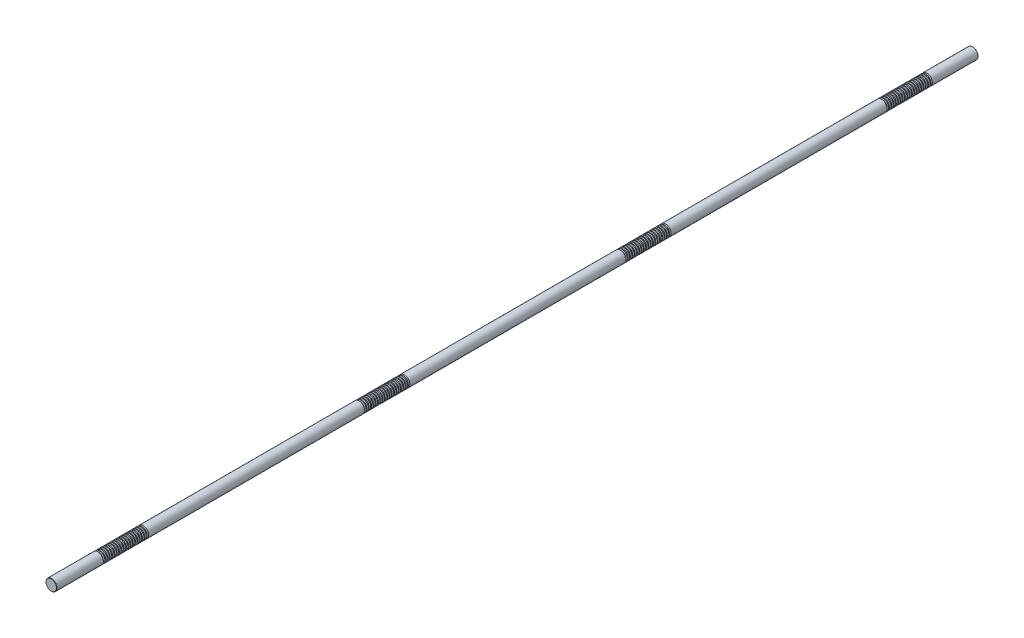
from build123d import *

# Parameters (mm, degrees)
SKETCH1_R           = 12
BOSS_EXTRUDE1_DEPTH = 1000
CHAMFER1_SIZE       = 0.6
LPATTERN1_COUNT     = 20
LPATTERN1_PITCH     = 5
LPATTERN2_COUNT     = 4
LPATTERN2_PITCH     = 567


with BuildPart() as part:
    # Sketch1 → Boss-Extrude1 (new, symmetric)
    with BuildSketch(Plane.XY):
        Circle(SKETCH1_R)
    extrude(amount=BOSS_EXTRUDE1_DEPTH, both=True)

    # Chamfer1
    chamfer1_edges = [part.edges().sort_by_distance(p)[0] for p in [
        (-12, 0, -1000),
        (-12, 0, 1000),
    ]]
    chamfer(chamfer1_edges, length=CHAMFER1_SIZE)

    # Sketch2 → Cut-Revolve1 (revolve, cut)
    with BuildSketch(Plane(origin=(0, 0, 0), x_dir=(0, 0, -1), z_dir=(1, 0, 0)), mode=Mode.PRIVATE) as cut_revolve1_sk:
        Polygon((900.36843014, 12), (897.13156986, 12), (897.86843014, 9.25), (899.63156986, 9.25), align=None)
    cut_revolve1 = revolve(cut_revolve1_sk.sketch.rotate(Axis((0, 0, 1000), (0, 0, -1)), 90), axis=Axis((0, 0, 1000), (0, 0, -1)), mode=Mode.SUBTRACT)

    # LPattern1: Cut-Revolve1 ×20
    with Locations(*[(0, 0, i * LPATTERN1_PITCH) for i in range(1, LPATTERN1_COUNT)]):
        add(cut_revolve1, mode=Mode.SUBTRACT)

    # LPattern2: Cut-Revolve1 ×4
    with Locations(*[(0, 0, i * LPATTERN2_PITCH) for i in range(1, LPATTERN2_COUNT)]):
        add(cut_revolve1, mode=Mode.SUBTRACT)

    # LPattern2 copy 1 sketch → LPattern2 copy 1 (revolve, cut)
    with BuildSketch(Plane(origin=(0, 0, 572), x_dir=(0, 0, -1), z_dir=(1, 0, 0))):
        Polygon((900.36843014, 12), (897.13156986, 12), (897.86843014, 9.25), (899.63156986, 9.25), align=None)
    revolve(axis=Axis((0, 0, 1572), (0, 0, -1)), mode=Mode.SUBTRACT)

    # LPattern2 copy 2 sketch → LPattern2 copy 2 (revolve, cut)
    with BuildSketch(Plane(origin=(0, 0, 1139), x_dir=(0, 0, -1), z_dir=(1, 0, 0))):
        Polygon((900.36843014, 12), (897.13156986, 12), (897.86843014, 9.25), (899.63156986, 9.25), align=None)
    revolve(axis=Axis((0, 0, 2139), (0, 0, -1)), mode=Mode.SUBTRACT)

    # LPattern2 copy 3 sketch → LPattern2 copy 3 (revolve, cut)
    with BuildSketch(Plane(origin=(0, 0, 1706), x_dir=(0, 0, -1), z_dir=(1, 0, 0))):
        Polygon((900.36843014, 12), (897.13156986, 12), (897.86843014, 9.25), (899.63156986, 9.25), align=None)
    revolve(axis=Axis((0, 0, 2706), (0, 0, -1)), mode=Mode.SUBTRACT)

    # LPattern2 copy 4 sketch → LPattern2 copy 4 (revolve, cut)
    with BuildSketch(Plane(origin=(0, 0, 577), x_dir=(0, 0, -1), z_dir=(1, 0, 0))):
        Polygon((900.36843014, 12), (897.13156986, 12), (897.86843014, 9.25), (899.63156986, 9.25), align=None)
    revolve(axis=Axis((0, 0, 1577), (0, 0, -1)), mode=Mode.SUBTRACT)

    # LPattern2 copy 5 sketch → LPattern2 copy 5 (revolve, cut)
    with BuildSketch(Plane(origin=(0, 0, 1144), x_dir=(0, 0, -1), z_dir=(1, 0, 0))):
        Polygon((900.36843014, 12), (897.13156986, 12), (897.86843014, 9.25), (899.63156986, 9.25), align=None)
    revolve(axis=Axis((0, 0, 2144), (0, 0, -1)), mode=Mode.SUBTRACT)

    # LPattern2 copy 6 sketch → LPattern2 copy 6 (revolve, cut)
    with BuildSketch(Plane(origin=(0, 0, 1711), x_dir=(0, 0, -1), z_dir=(1, 0, 0))):
        Polygon((900.36843014, 12), (897.13156986, 12), (897.86843014, 9.25), (899.63156986, 9.25), align=None)
    revolve(axis=Axis((0, 0, 2711), (0, 0, -1)), mode=Mode.SUBTRACT)

    # LPattern2 copy 7 sketch → LPattern2 copy 7 (revolve, cut)
    with BuildSketch(Plane(origin=(0, 0, 582), x_dir=(0, 0, -1), z_dir=(1, 0, 0))):
        Polygon((900.36843014, 12), (897.13156986, 12), (897.86843014, 9.25), (899.63156986, 9.25), align=None)
    revolve(axis=Axis((0, 0, 1582), (0, 0, -1)), mode=Mode.SUBTRACT)

    # LPattern2 copy 8 sketch → LPattern2 copy 8 (revolve, cut)
    with BuildSketch(Plane(origin=(0, 0, 1149), x_dir=(0, 0, -1), z_dir=(1, 0, 0))):
        Polygon((900.36843014, 12), (897.13156986, 12), (897.86843014, 9.25), (899.63156986, 9.25), align=None)
    revolve(axis=Axis((0, 0, 2149), (0, 0, -1)), mode=Mode.SUBTRACT)

    # LPattern2 copy 9 sketch → LPattern2 copy 9 (revolve, cut)
    with BuildSketch(Plane(origin=(0, 0, 1716), x_dir=(0, 0, -1), z_dir=(1, 0, 0))):
        Polygon((900.36843014, 12), (897.13156986, 12), (897.86843014, 9.25), (899.63156986, 9.25), align=None)
    revolve(axis=Axis((0, 0, 2716), (0, 0, -1)), mode=Mode.SUBTRACT)

    # LPattern2 copy 10 sketch → LPattern2 copy 10 (revolve, cut)
    with BuildSketch(Plane(origin=(0, 0, 587), x_dir=(0, 0, -1), z_dir=(1, 0, 0))):
        Polygon((900.36843014, 12), (897.13156986, 12), (897.86843014, 9.25), (899.63156986, 9.25), align=None)
    revolve(axis=Axis((0, 0, 1587), (0, 0, -1)), mode=Mode.SUBTRACT)

    # LPattern2 copy 11 sketch → LPattern2 copy 11 (revolve, cut)
    with BuildSketch(Plane(origin=(0, 0, 1154), x_dir=(0, 0, -1), z_dir=(1, 0, 0))):
        Polygon((900.36843014, 12), (897.13156986, 12), (897.86843014, 9.25), (899.63156986, 9.25), align=None)
    revolve(axis=Axis((0, 0, 2154), (0, 0, -1)), mode=Mode.SUBTRACT)

    # LPattern2 copy 12 sketch → LPattern2 copy 12 (revolve, cut)
    with BuildSketch(Plane(origin=(0, 0, 1721), x_dir=(0, 0, -1), z_dir=(1, 0, 0))):
        Polygon((900.36843014, 12), (897.13156986, 12), (897.86843014, 9.25), (899.63156986, 9.25), align=None)
    revolve(axis=Axis((0, 0, 2721), (0, 0, -1)), mode=Mode.SUBTRACT)

    # LPattern2 copy 13 sketch → LPattern2 copy 13 (revolve, cut)
    with BuildSketch(Plane(origin=(0, 0, 592), x_dir=(0, 0, -1), z_dir=(1, 0, 0))):
        Polygon((900.36843014, 12), (897.13156986, 12), (897.86843014, 9.25), (899.63156986, 9.25), align=None)
    revolve(axis=Axis((0, 0, 1592), (0, 0, -1)), mode=Mode.SUBTRACT)

    # LPattern2 copy 14 sketch → LPattern2 copy 14 (revolve, cut)
    with BuildSketch(Plane(origin=(0, 0, 1159), x_dir=(0, 0, -1), z_dir=(1, 0, 0))):
        Polygon((900.36843014, 12), (897.13156986, 12), (897.86843014, 9.25), (899.63156986, 9.25), align=None)
    revolve(axis=Axis((0, 0, 2159), (0, 0, -1)), mode=Mode.SUBTRACT)

    # LPattern2 copy 15 sketch → LPattern2 copy 15 (revolve, cut)
    with BuildSketch(Plane(origin=(0, 0, 1726), x_dir=(0, 0, -1), z_dir=(1, 0, 0))):
        Polygon((900.36843014, 12), (897.13156986, 12), (897.86843014, 9.25), (899.63156986, 9.25), align=None)
    revolve(axis=Axis((0, 0, 2726), (0, 0, -1)), mode=Mode.SUBTRACT)

    # LPattern2 copy 16 sketch → LPattern2 copy 16 (revolve, cut)
    with BuildSketch(Plane(origin=(0, 0, 597), x_dir=(0, 0, -1), z_dir=(1, 0, 0))):
        Polygon((900.36843014, 12), (897.13156986, 12), (897.86843014, 9.25), (899.63156986, 9.25), align=None)
    revolve(axis=Axis((0, 0, 1597), (0, 0, -1)), mode=Mode.SUBTRACT)

    # LPattern2 copy 17 sketch → LPattern2 copy 17 (revolve, cut)
    with BuildSketch(Plane(origin=(0, 0, 1164), x_dir=(0, 0, -1), z_dir=(1, 0, 0))):
        Polygon((900.36843014, 12), (897.13156986, 12), (897.86843014, 9.25), (899.63156986, 9.25), align=None)
    revolve(axis=Axis((0, 0, 2164), (0, 0, -1)), mode=Mode.SUBTRACT)

    # LPattern2 copy 18 sketch → LPattern2 copy 18 (revolve, cut)
    with BuildSketch(Plane(origin=(0, 0, 1731), x_dir=(0, 0, -1), z_dir=(1, 0, 0))):
        Polygon((900.36843014, 12), (897.13156986, 12), (897.86843014, 9.25), (899.63156986, 9.25), align=None)
    revolve(axis=Axis((0, 0, 2731), (0, 0, -1)), mode=Mode.SUBTRACT)

    # LPattern2 copy 19 sketch → LPattern2 copy 19 (revolve, cut)
    with BuildSketch(Plane(origin=(0, 0, 602), x_dir=(0, 0, -1), z_dir=(1, 0, 0))):
        Polygon((900.36843014, 12), (897.13156986, 12), (897.86843014, 9.25), (899.63156986, 9.25), align=None)
    revolve(axis=Axis((0, 0, 1602), (0, 0, -1)), mode=Mode.SUBTRACT)

    # LPattern2 copy 20 sketch → LPattern2 copy 20 (revolve, cut)
    with BuildSketch(Plane(origin=(0, 0, 1169), x_dir=(0, 0, -1), z_dir=(1, 0, 0))):
        Polygon((900.36843014, 12), (897.13156986, 12), (897.86843014, 9.25), (899.63156986, 9.25), align=None)
    revolve(axis=Axis((0, 0, 2169), (0, 0, -1)), mode=Mode.SUBTRACT)

    # LPattern2 copy 21 sketch → LPattern2 copy 21 (revolve, cut)
    with BuildSketch(Plane(origin=(0, 0, 1736), x_dir=(0, 0, -1), z_dir=(1, 0, 0))):
        Polygon((900.36843014, 12), (897.13156986, 12), (897.86843014, 9.25), (899.63156986, 9.25), align=None)
    revolve(axis=Axis((0, 0, 2736), (0, 0, -1)), mode=Mode.SUBTRACT)

    # LPattern2 copy 22 sketch → LPattern2 copy 22 (revolve, cut)
    with BuildSketch(Plane(origin=(0, 0, 607), x_dir=(0, 0, -1), z_dir=(1, 0, 0))):
        Polygon((900.36843014, 12), (897.13156986, 12), (897.86843014, 9.25), (899.63156986, 9.25), align=None)
    revolve(axis=Axis((0, 0, 1607), (0, 0, -1)), mode=Mode.SUBTRACT)

    # LPattern2 copy 23 sketch → LPattern2 copy 23 (revolve, cut)
    with BuildSketch(Plane(origin=(0, 0, 1174), x_dir=(0, 0, -1), z_dir=(1, 0, 0))):
        Polygon((900.36843014, 12), (897.13156986, 12), (897.86843014, 9.25), (899.63156986, 9.25), align=None)
    revolve(axis=Axis((0, 0, 2174), (0, 0, -1)), mode=Mode.SUBTRACT)

    # LPattern2 copy 24 sketch → LPattern2 copy 24 (revolve, cut)
    with BuildSketch(Plane(origin=(0, 0, 1741), x_dir=(0, 0, -1), z_dir=(1, 0, 0))):
        Polygon((900.36843014, 12), (897.13156986, 12), (897.86843014, 9.25), (899.63156986, 9.25), align=None)
    revolve(axis=Axis((0, 0, 2741), (0, 0, -1)), mode=Mode.SUBTRACT)

    # LPattern2 copy 25 sketch → LPattern2 copy 25 (revolve, cut)
    with BuildSketch(Plane(origin=(0, 0, 612), x_dir=(0, 0, -1), z_dir=(1, 0, 0))):
        Polygon((900.36843014, 12), (897.13156986, 12), (897.86843014, 9.25), (899.63156986, 9.25), align=None)
    revolve(axis=Axis((0, 0, 1612), (0, 0, -1)), mode=Mode.SUBTRACT)

    # LPattern2 copy 26 sketch → LPattern2 copy 26 (revolve, cut)
    with BuildSketch(Plane(origin=(0, 0, 1179), x_dir=(0, 0, -1), z_dir=(1, 0, 0))):
        Polygon((900.36843014, 12), (897.13156986, 12), (897.86843014, 9.25), (899.63156986, 9.25), align=None)
    revolve(axis=Axis((0, 0, 2179), (0, 0, -1)), mode=Mode.SUBTRACT)

    # LPattern2 copy 27 sketch → LPattern2 copy 27 (revolve, cut)
    with BuildSketch(Plane(origin=(0, 0, 1746), x_dir=(0, 0, -1), z_dir=(1, 0, 0))):
        Polygon((900.36843014, 12), (897.13156986, 12), (897.86843014, 9.25), (899.63156986, 9.25), align=None)
    revolve(axis=Axis((0, 0, 2746), (0, 0, -1)), mode=Mode.SUBTRACT)

    # LPattern2 copy 28 sketch → LPattern2 copy 28 (revolve, cut)
    with BuildSketch(Plane(origin=(0, 0, 617), x_dir=(0, 0, -1), z_dir=(1, 0, 0))):
        Polygon((900.36843014, 12), (897.13156986, 12), (897.86843014, 9.25), (899.63156986, 9.25), align=None)
    revolve(axis=Axis((0, 0, 1617), (0, 0, -1)), mode=Mode.SUBTRACT)

    # LPattern2 copy 29 sketch → LPattern2 copy 29 (revolve, cut)
    with BuildSketch(Plane(origin=(0, 0, 1184), x_dir=(0, 0, -1), z_dir=(1, 0, 0))):
        Polygon((900.36843014, 12), (897.13156986, 12), (897.86843014, 9.25), (899.63156986, 9.25), align=None)
    revolve(axis=Axis((0, 0, 2184), (0, 0, -1)), mode=Mode.SUBTRACT)

    # LPattern2 copy 30 sketch → LPattern2 copy 30 (revolve, cut)
    with BuildSketch(Plane(origin=(0, 0, 1751), x_dir=(0, 0, -1), z_dir=(1, 0, 0))):
        Polygon((900.36843014, 12), (897.13156986, 12), (897.86843014, 9.25), (899.63156986, 9.25), align=None)
    revolve(axis=Axis((0, 0, 2751), (0, 0, -1)), mode=Mode.SUBTRACT)

    # LPattern2 copy 31 sketch → LPattern2 copy 31 (revolve, cut)
    with BuildSketch(Plane(origin=(0, 0, 622), x_dir=(0, 0, -1), z_dir=(1, 0, 0))):
        Polygon((900.36843014, 12), (897.13156986, 12), (897.86843014, 9.25), (899.63156986, 9.25), align=None)
    revolve(axis=Axis((0, 0, 1622), (0, 0, -1)), mode=Mode.SUBTRACT)

    # LPattern2 copy 32 sketch → LPattern2 copy 32 (revolve, cut)
    with BuildSketch(Plane(origin=(0, 0, 1189), x_dir=(0, 0, -1), z_dir=(1, 0, 0))):
        Polygon((900.36843014, 12), (897.13156986, 12), (897.86843014, 9.25), (899.63156986, 9.25), align=None)
    revolve(axis=Axis((0, 0, 2189), (0, 0, -1)), mode=Mode.SUBTRACT)

    # LPattern2 copy 33 sketch → LPattern2 copy 33 (revolve, cut)
    with BuildSketch(Plane(origin=(0, 0, 1756), x_dir=(0, 0, -1), z_dir=(1, 0, 0))):
        Polygon((900.36843014, 12), (897.13156986, 12), (897.86843014, 9.25), (899.63156986, 9.25), align=None)
    revolve(axis=Axis((0, 0, 2756), (0, 0, -1)), mode=Mode.SUBTRACT)

    # LPattern2 copy 34 sketch → LPattern2 copy 34 (revolve, cut)
    with BuildSketch(Plane(origin=(0, 0, 627), x_dir=(0, 0, -1), z_dir=(1, 0, 0))):
        Polygon((900.36843014, 12), (897.13156986, 12), (897.86843014, 9.25), (899.63156986, 9.25), align=None)
    revolve(axis=Axis((0, 0, 1627), (0, 0, -1)), mode=Mode.SUBTRACT)

    # LPattern2 copy 35 sketch → LPattern2 copy 35 (revolve, cut)
    with BuildSketch(Plane(origin=(0, 0, 1194), x_dir=(0, 0, -1), z_dir=(1, 0, 0))):
        Polygon((900.36843014, 12), (897.13156986, 12), (897.86843014, 9.25), (899.63156986, 9.25), align=None)
    revolve(axis=Axis((0, 0, 2194), (0, 0, -1)), mode=Mode.SUBTRACT)

    # LPattern2 copy 36 sketch → LPattern2 copy 36 (revolve, cut)
    with BuildSketch(Plane(origin=(0, 0, 1761), x_dir=(0, 0, -1), z_dir=(1, 0, 0))):
        Polygon((900.36843014, 12), (897.13156986, 12), (897.86843014, 9.25), (899.63156986, 9.25), align=None)
    revolve(axis=Axis((0, 0, 2761), (0, 0, -1)), mode=Mode.SUBTRACT)

    # LPattern2 copy 37 sketch → LPattern2 copy 37 (revolve, cut)
    with BuildSketch(Plane(origin=(0, 0, 632), x_dir=(0, 0, -1), z_dir=(1, 0, 0))):
        Polygon((900.36843014, 12), (897.13156986, 12), (897.86843014, 9.25), (899.63156986, 9.25), align=None)
    revolve(axis=Axis((0, 0, 1632), (0, 0, -1)), mode=Mode.SUBTRACT)

    # LPattern2 copy 38 sketch → LPattern2 copy 38 (revolve, cut)
    with BuildSketch(Plane(origin=(0, 0, 1199), x_dir=(0, 0, -1), z_dir=(1, 0, 0))):
        Polygon((900.36843014, 12), (897.13156986, 12), (897.86843014, 9.25), (899.63156986, 9.25), align=None)
    revolve(axis=Axis((0, 0, 2199), (0, 0, -1)), mode=Mode.SUBTRACT)

    # LPattern2 copy 39 sketch → LPattern2 copy 39 (revolve, cut)
    with BuildSketch(Plane(origin=(0, 0, 1766), x_dir=(0, 0, -1), z_dir=(1, 0, 0))):
        Polygon((900.36843014, 12), (897.13156986, 12), (897.86843014, 9.25), (899.63156986, 9.25), align=None)
    revolve(axis=Axis((0, 0, 2766), (0, 0, -1)), mode=Mode.SUBTRACT)

    # LPattern2 copy 40 sketch → LPattern2 copy 40 (revolve, cut)
    with BuildSketch(Plane(origin=(0, 0, 637), x_dir=(0, 0, -1), z_dir=(1, 0, 0))):
        Polygon((900.36843014, 12), (897.13156986, 12), (897.86843014, 9.25), (899.63156986, 9.25), align=None)
    revolve(axis=Axis((0, 0, 1637), (0, 0, -1)), mode=Mode.SUBTRACT)

    # LPattern2 copy 41 sketch → LPattern2 copy 41 (revolve, cut)
    with BuildSketch(Plane(origin=(0, 0, 1204), x_dir=(0, 0, -1), z_dir=(1, 0, 0))):
        Polygon((900.36843014, 12), (897.13156986, 12), (897.86843014, 9.25), (899.63156986, 9.25), align=None)
    revolve(axis=Axis((0, 0, 2204), (0, 0, -1)), mode=Mode.SUBTRACT)

    # LPattern2 copy 42 sketch → LPattern2 copy 42 (revolve, cut)
    with BuildSketch(Plane(origin=(0, 0, 1771), x_dir=(0, 0, -1), z_dir=(1, 0, 0))):
        Polygon((900.36843014, 12), (897.13156986, 12), (897.86843014, 9.25), (899.63156986, 9.25), align=None)
    revolve(axis=Axis((0, 0, 2771), (0, 0, -1)), mode=Mode.SUBTRACT)

    # LPattern2 copy 43 sketch → LPattern2 copy 43 (revolve, cut)
    with BuildSketch(Plane(origin=(0, 0, 642), x_dir=(0, 0, -1), z_dir=(1, 0, 0))):
        Polygon((900.36843014, 12), (897.13156986, 12), (897.86843014, 9.25), (899.63156986, 9.25), align=None)
    revolve(axis=Axis((0, 0, 1642), (0, 0, -1)), mode=Mode.SUBTRACT)

    # LPattern2 copy 44 sketch → LPattern2 copy 44 (revolve, cut)
    with BuildSketch(Plane(origin=(0, 0, 1209), x_dir=(0, 0, -1), z_dir=(1, 0, 0))):
        Polygon((900.36843014, 12), (897.13156986, 12), (897.86843014, 9.25), (899.63156986, 9.25), align=None)
    revolve(axis=Axis((0, 0, 2209), (0, 0, -1)), mode=Mode.SUBTRACT)

    # LPattern2 copy 45 sketch → LPattern2 copy 45 (revolve, cut)
    with BuildSketch(Plane(origin=(0, 0, 1776), x_dir=(0, 0, -1), z_dir=(1, 0, 0))):
        Polygon((900.36843014, 12), (897.13156986, 12), (897.86843014, 9.25), (899.63156986, 9.25), align=None)
    revolve(axis=Axis((0, 0, 2776), (0, 0, -1)), mode=Mode.SUBTRACT)

    # LPattern2 copy 46 sketch → LPattern2 copy 46 (revolve, cut)
    with BuildSketch(Plane(origin=(0, 0, 647), x_dir=(0, 0, -1), z_dir=(1, 0, 0))):
        Polygon((900.36843014, 12), (897.13156986, 12), (897.86843014, 9.25), (899.63156986, 9.25), align=None)
    revolve(axis=Axis((0, 0, 1647), (0, 0, -1)), mode=Mode.SUBTRACT)

    # LPattern2 copy 47 sketch → LPattern2 copy 47 (revolve, cut)
    with BuildSketch(Plane(origin=(0, 0, 1214), x_dir=(0, 0, -1), z_dir=(1, 0, 0))):
        Polygon((900.36843014, 12), (897.13156986, 12), (897.86843014, 9.25), (899.63156986, 9.25), align=None)
    revolve(axis=Axis((0, 0, 2214), (0, 0, -1)), mode=Mode.SUBTRACT)

    # LPattern2 copy 48 sketch → LPattern2 copy 48 (revolve, cut)
    with BuildSketch(Plane(origin=(0, 0, 1781), x_dir=(0, 0, -1), z_dir=(1, 0, 0))):
        Polygon((900.36843014, 12), (897.13156986, 12), (897.86843014, 9.25), (899.63156986, 9.25), align=None)
    revolve(axis=Axis((0, 0, 2781), (0, 0, -1)), mode=Mode.SUBTRACT)

    # LPattern2 copy 49 sketch → LPattern2 copy 49 (revolve, cut)
    with BuildSketch(Plane(origin=(0, 0, 652), x_dir=(0, 0, -1), z_dir=(1, 0, 0))):
        Polygon((900.36843014, 12), (897.13156986, 12), (897.86843014, 9.25), (899.63156986, 9.25), align=None)
    revolve(axis=Axis((0, 0, 1652), (0, 0, -1)), mode=Mode.SUBTRACT)

    # LPattern2 copy 50 sketch → LPattern2 copy 50 (revolve, cut)
    with BuildSketch(Plane(origin=(0, 0, 1219), x_dir=(0, 0, -1), z_dir=(1, 0, 0))):
        Polygon((900.36843014, 12), (897.13156986, 12), (897.86843014, 9.25), (899.63156986, 9.25), align=None)
    revolve(axis=Axis((0, 0, 2219), (0, 0, -1)), mode=Mode.SUBTRACT)

    # LPattern2 copy 51 sketch → LPattern2 copy 51 (revolve, cut)
    with BuildSketch(Plane(origin=(0, 0, 1786), x_dir=(0, 0, -1), z_dir=(1, 0, 0))):
        Polygon((900.36843014, 12), (897.13156986, 12), (897.86843014, 9.25), (899.63156986, 9.25), align=None)
    revolve(axis=Axis((0, 0, 2786), (0, 0, -1)), mode=Mode.SUBTRACT)

    # LPattern2 copy 52 sketch → LPattern2 copy 52 (revolve, cut)
    with BuildSketch(Plane(origin=(0, 0, 657), x_dir=(0, 0, -1), z_dir=(1, 0, 0))):
        Polygon((900.36843014, 12), (897.13156986, 12), (897.86843014, 9.25), (899.63156986, 9.25), align=None)
    revolve(axis=Axis((0, 0, 1657), (0, 0, -1)), mode=Mode.SUBTRACT)

    # LPattern2 copy 53 sketch → LPattern2 copy 53 (revolve, cut)
    with BuildSketch(Plane(origin=(0, 0, 1224), x_dir=(0, 0, -1), z_dir=(1, 0, 0))):
        Polygon((900.36843014, 12), (897.13156986, 12), (897.86843014, 9.25), (899.63156986, 9.25), align=None)
    revolve(axis=Axis((0, 0, 2224), (0, 0, -1)), mode=Mode.SUBTRACT)

    # LPattern2 copy 54 sketch → LPattern2 copy 54 (revolve, cut)
    with BuildSketch(Plane(origin=(0, 0, 1791), x_dir=(0, 0, -1), z_dir=(1, 0, 0))):
        Polygon((900.36843014, 12), (897.13156986, 12), (897.86843014, 9.25), (899.63156986, 9.25), align=None)
    revolve(axis=Axis((0, 0, 2791), (0, 0, -1)), mode=Mode.SUBTRACT)

    # LPattern2 copy 55 sketch → LPattern2 copy 55 (revolve, cut)
    with BuildSketch(Plane(origin=(0, 0, 662), x_dir=(0, 0, -1), z_dir=(1, 0, 0))):
        Polygon((900.36843014, 12), (897.13156986, 12), (897.86843014, 9.25), (899.63156986, 9.25), align=None)
    revolve(axis=Axis((0, 0, 1662), (0, 0, -1)), mode=Mode.SUBTRACT)

    # LPattern2 copy 56 sketch → LPattern2 copy 56 (revolve, cut)
    with BuildSketch(Plane(origin=(0, 0, 1229), x_dir=(0, 0, -1), z_dir=(1, 0, 0))):
        Polygon((900.36843014, 12), (897.13156986, 12), (897.86843014, 9.25), (899.63156986, 9.25), align=None)
    revolve(axis=Axis((0, 0, 2229), (0, 0, -1)), mode=Mode.SUBTRACT)

    # LPattern2 copy 57 sketch → LPattern2 copy 57 (revolve, cut)
    with BuildSketch(Plane(origin=(0, 0, 1796), x_dir=(0, 0, -1), z_dir=(1, 0, 0))):
        Polygon((900.36843014, 12), (897.13156986, 12), (897.86843014, 9.25), (899.63156986, 9.25), align=None)
    revolve(axis=Axis((0, 0, 2796), (0, 0, -1)), mode=Mode.SUBTRACT)


solid = part.part
